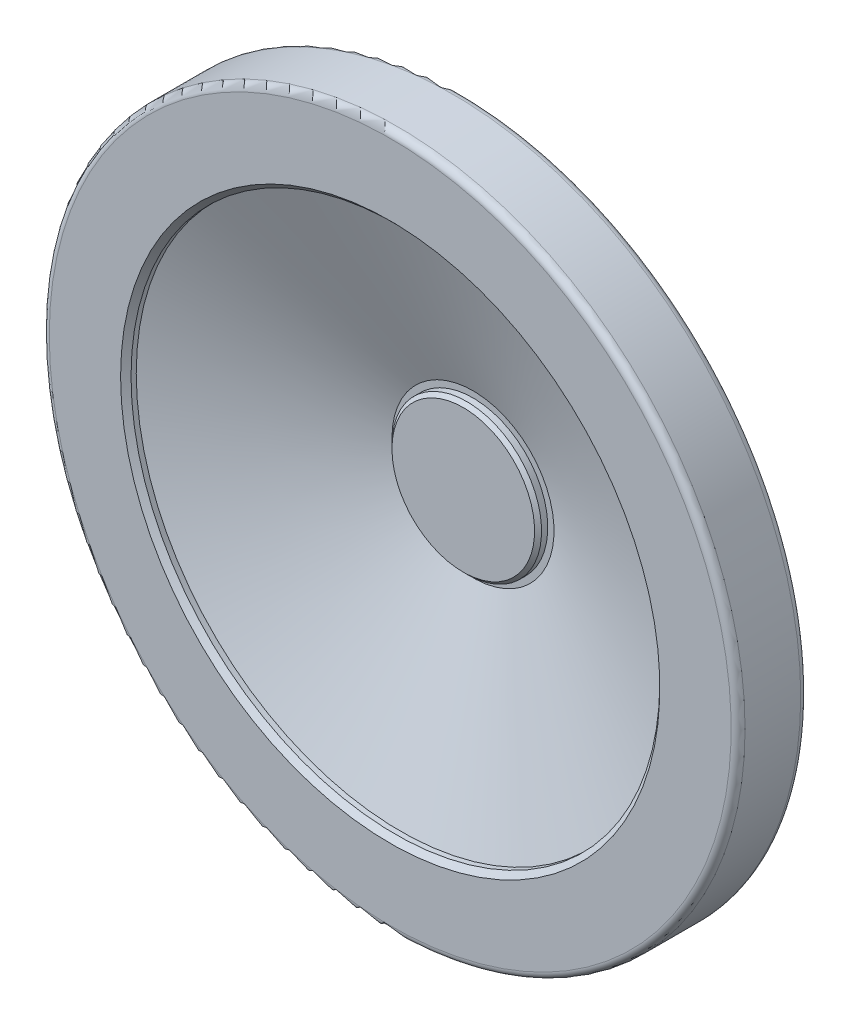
ISO-10303-21;
HEADER;
FILE_DESCRIPTION(('STEP AP214'),'2;1');
FILE_NAME('part.step','',(''),(''),'','','');
FILE_SCHEMA(('AUTOMOTIVE_DESIGN { 1 0 10303 214 1 1 1 1 }'));
ENDSEC;
DATA;
#1=APPLICATION_CONTEXT('core data for automotive mechanical design processes');
#2=APPLICATION_PROTOCOL_DEFINITION('international standard','automotive_design',2000,#1);
#3=PRODUCT_CONTEXT('',#1,'mechanical');
#4=PRODUCT('Part','Part','',(#3));
#5=PRODUCT_RELATED_PRODUCT_CATEGORY('part','',(#4));
#6=PRODUCT_DEFINITION_FORMATION('','',#4);
#7=PRODUCT_DEFINITION_CONTEXT('part definition',#1,'design');
#8=PRODUCT_DEFINITION('design','',#6,#7);
#9=PRODUCT_DEFINITION_SHAPE('','',#8);
#10=(LENGTH_UNIT() NAMED_UNIT(*) SI_UNIT(.MILLI.,.METRE.));
#11=(NAMED_UNIT(*) PLANE_ANGLE_UNIT() SI_UNIT($,.RADIAN.));
#12=(NAMED_UNIT(*) SI_UNIT($,.STERADIAN.) SOLID_ANGLE_UNIT());
#13=UNCERTAINTY_MEASURE_WITH_UNIT(LENGTH_MEASURE(1.E-05),#10,'distance_accuracy_value','');
#14=(GEOMETRIC_REPRESENTATION_CONTEXT(3) GLOBAL_UNCERTAINTY_ASSIGNED_CONTEXT((#13)) GLOBAL_UNIT_ASSIGNED_CONTEXT((#10,
#11,#12)) REPRESENTATION_CONTEXT('',''));
#15=CARTESIAN_POINT('',(0.,0.,0.));
#16=DIRECTION('',(0.,0.,1.));
#17=DIRECTION('',(1.,0.,0.));
#18=AXIS2_PLACEMENT_3D('',#15,#16,#17);
#19=CARTESIAN_POINT('',(0.,0.,54.));
#20=DIRECTION('',(0.,0.,1.));
#21=DIRECTION('',(-1.,0.,0.));
#22=AXIS2_PLACEMENT_3D('',#19,#20,#21);
#23=CONICAL_SURFACE('',#22,76.0000000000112,1.1950442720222);
#24=CARTESIAN_POINT('',(0.,0.,33.2042442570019));
#25=DIRECTION('',(0.,0.,1.));
#26=DIRECTION('',(-1.,0.,0.));
#27=AXIS2_PLACEMENT_3D('',#24,#25,#26);
#28=CIRCLE('',#27,23.2851773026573);
#29=CARTESIAN_POINT('',(-23.2851773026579,0.,33.2042442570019));
#30=VERTEX_POINT('',#29);
#31=EDGE_CURVE('E9',#30,#30,#28,.T.);
#32=CARTESIAN_POINT('',(0.,0.,54.));
#33=DIRECTION('',(0.,0.,1.));
#34=DIRECTION('',(-1.,0.,0.));
#35=AXIS2_PLACEMENT_3D('',#32,#33,#34);
#36=CIRCLE('',#35,76.0000000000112);
#37=CARTESIAN_POINT('',(-76.0000000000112,0.,54.));
#38=VERTEX_POINT('',#37);
#39=EDGE_CURVE('E59',#38,#38,#36,.T.);
#40=CARTESIAN_POINT('',(-23.2851773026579,0.,33.2042442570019));
#41=CARTESIAN_POINT('',(-23.8342900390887,0.,33.4208667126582));
#42=CARTESIAN_POINT('',(-24.3834027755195,0.,33.6374891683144));
#43=CARTESIAN_POINT('',(-25.481628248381,0.,34.0707340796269));
#44=CARTESIAN_POINT('',(-26.0307409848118,0.,34.2873565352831));
#45=CARTESIAN_POINT('',(-27.1289664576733,0.,34.7206014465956));
#46=CARTESIAN_POINT('',(-27.678079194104,0.,34.9372239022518));
#47=CARTESIAN_POINT('',(-28.7763046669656,0.,35.3704688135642));
#48=CARTESIAN_POINT('',(-29.3254174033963,0.,35.5870912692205));
#49=CARTESIAN_POINT('',(-30.4236428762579,0.,36.0203361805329));
#50=CARTESIAN_POINT('',(-30.9727556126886,0.,36.2369586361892));
#51=CARTESIAN_POINT('',(-32.0709810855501,0.,36.6702035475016));
#52=CARTESIAN_POINT('',(-32.6200938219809,0.,36.8868260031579));
#53=CARTESIAN_POINT('',(-33.7183192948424,0.,37.3200709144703));
#54=CARTESIAN_POINT('',(-34.2674320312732,0.,37.5366933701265));
#55=CARTESIAN_POINT('',(-35.3656575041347,0.,37.969938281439));
#56=CARTESIAN_POINT('',(-35.9147702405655,0.,38.1865607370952));
#57=CARTESIAN_POINT('',(-37.012995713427,0.,38.6198056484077));
#58=CARTESIAN_POINT('',(-37.5621084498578,0.,38.8364281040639));
#59=CARTESIAN_POINT('',(-38.6603339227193,0.,39.2696730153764));
#60=CARTESIAN_POINT('',(-39.2094466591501,0.,39.4862954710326));
#61=CARTESIAN_POINT('',(-40.3076721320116,0.,39.9195403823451));
#62=CARTESIAN_POINT('',(-40.8567848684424,0.,40.1361628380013));
#63=CARTESIAN_POINT('',(-41.9550103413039,0.,40.5694077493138));
#64=CARTESIAN_POINT('',(-42.5041230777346,0.,40.78603020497));
#65=CARTESIAN_POINT('',(-43.6023485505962,0.,41.2192751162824));
#66=CARTESIAN_POINT('',(-44.1514612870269,0.,41.4358975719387));
#67=CARTESIAN_POINT('',(-45.2496867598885,0.,41.8691424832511));
#68=CARTESIAN_POINT('',(-45.7987994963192,0.,42.0857649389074));
#69=CARTESIAN_POINT('',(-46.8970249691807,0.,42.5190098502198));
#70=CARTESIAN_POINT('',(-47.4461377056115,0.,42.7356323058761));
#71=CARTESIAN_POINT('',(-48.544363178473,0.,43.1688772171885));
#72=CARTESIAN_POINT('',(-49.0934759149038,0.,43.3854996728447));
#73=CARTESIAN_POINT('',(-50.1917013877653,0.,43.8187445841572));
#74=CARTESIAN_POINT('',(-50.7408141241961,0.,44.0353670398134));
#75=CARTESIAN_POINT('',(-51.8390395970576,0.,44.4686119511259));
#76=CARTESIAN_POINT('',(-52.3881523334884,0.,44.6852344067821));
#77=CARTESIAN_POINT('',(-53.4863778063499,0.,45.1184793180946));
#78=CARTESIAN_POINT('',(-54.0354905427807,0.,45.3351017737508));
#79=CARTESIAN_POINT('',(-55.1337160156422,0.,45.7683466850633));
#80=CARTESIAN_POINT('',(-55.682828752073,0.,45.9849691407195));
#81=CARTESIAN_POINT('',(-56.7810542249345,0.,46.418214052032));
#82=CARTESIAN_POINT('',(-57.3301669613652,0.,46.6348365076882));
#83=CARTESIAN_POINT('',(-58.4283924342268,0.,47.0680814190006));
#84=CARTESIAN_POINT('',(-58.9775051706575,0.,47.2847038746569));
#85=CARTESIAN_POINT('',(-60.0757306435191,0.,47.7179487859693));
#86=CARTESIAN_POINT('',(-60.6248433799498,0.,47.9345712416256));
#87=CARTESIAN_POINT('',(-61.7230688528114,0.,48.367816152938));
#88=CARTESIAN_POINT('',(-62.2721815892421,0.,48.5844386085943));
#89=CARTESIAN_POINT('',(-63.3704070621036,0.,49.0176835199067));
#90=CARTESIAN_POINT('',(-63.9195197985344,0.,49.2343059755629));
#91=CARTESIAN_POINT('',(-65.0177452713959,0.,49.6675508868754));
#92=CARTESIAN_POINT('',(-65.5668580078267,0.,49.8841733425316));
#93=CARTESIAN_POINT('',(-66.6650834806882,0.,50.3174182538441));
#94=CARTESIAN_POINT('',(-67.214196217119,0.,50.5340407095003));
#95=CARTESIAN_POINT('',(-68.3124216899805,0.,50.9672856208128));
#96=CARTESIAN_POINT('',(-68.8615344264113,0.,51.183908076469));
#97=CARTESIAN_POINT('',(-69.9597598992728,0.,51.6171529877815));
#98=CARTESIAN_POINT('',(-70.5088726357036,0.,51.8337754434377));
#99=CARTESIAN_POINT('',(-71.6070981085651,0.,52.2670203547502));
#100=CARTESIAN_POINT('',(-72.1562108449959,0.,52.4836428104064));
#101=CARTESIAN_POINT('',(-73.2544363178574,0.,52.9168877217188));
#102=CARTESIAN_POINT('',(-73.8035490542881,0.,53.1335101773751));
#103=CARTESIAN_POINT('',(-74.9017745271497,0.,53.5667550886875));
#104=CARTESIAN_POINT('',(-75.4508872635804,0.,53.7833775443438));
#105=CARTESIAN_POINT('',(-76.0000000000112,0.,54.));
#106=B_SPLINE_CURVE_WITH_KNOTS('',3,(#40,#41,#42,#43,#44,#45,#46,#47,#48,#49,#50,#51,#52,#53,
#54,#55,#56,#57,#58,#59,#60,#61,#62,#63,#64,#65,#66,#67,#68,#69,#70,#71,#72,#73,#74,#75,#76,#77,
#78,#79,#80,#81,#82,#83,#84,#85,#86,#87,#88,#89,#90,#91,#92,#93,#94,#95,#96,#97,#98,#99,#100,
#101,#102,#103,#104,#105),.UNSPECIFIED.,.F.,.F.,(4,2,2,2,2,2,2,2,2,2,2,2,2,2,2,2,2,2,2,2,2,2,2,
2,2,2,2,2,2,2,2,2,4),(0.,1.77088982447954,3.54177964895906,5.31266947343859,7.08355929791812,
8.85444912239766,10.6253389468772,12.3962287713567,14.1671185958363,15.9380084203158,
17.7088982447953,19.4797880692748,21.2506778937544,23.0215677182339,24.7924575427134,
26.563347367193,28.3342371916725,30.105127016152,31.8760168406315,33.6469066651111,
35.4177964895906,37.1886863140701,38.9595761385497,40.7304659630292,42.5013557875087,
44.2722456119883,46.0431354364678,47.8140252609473,49.5849150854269,51.3558049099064,
53.1266947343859,54.8975845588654,56.668474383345),.UNSPECIFIED.);
#107=EDGE_CURVE('BSEAM14',#30,#38,#106,.T.);
#108=ORIENTED_EDGE('',*,*,#31,.F.);
#109=ORIENTED_EDGE('',*,*,#39,.T.);
#110=ORIENTED_EDGE('',*,*,#107,.T.);
#111=ORIENTED_EDGE('',*,*,#107,.F.);
#112=EDGE_LOOP('',(#108,#110,#109,#111));
#113=FACE_BOUND('',#112,.T.);
#114=ADVANCED_FACE('F14',(#113),#23,.F.);
#115=CARTESIAN_POINT('',(0.,-23.2851773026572,33.2042442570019));
#116=DIRECTION('',(0.,0.,-1.));
#117=DIRECTION('',(1.,0.,0.));
#118=AXIS2_PLACEMENT_3D('',#115,#116,#117);
#119=PLANE('',#118);
#120=CARTESIAN_POINT('',(0.,0.,33.2042442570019));
#121=DIRECTION('',(0.,0.,1.));
#122=DIRECTION('',(-1.,0.,0.));
#123=AXIS2_PLACEMENT_3D('',#120,#121,#122);
#124=CIRCLE('',#123,21.500000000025);
#125=CARTESIAN_POINT('',(-21.500000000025,0.,33.2042442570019));
#126=VERTEX_POINT('',#125);
#127=EDGE_CURVE('E20',#126,#126,#124,.T.);
#128=ORIENTED_EDGE('',*,*,#127,.F.);
#129=EDGE_LOOP('',(#128));
#130=FACE_BOUND('',#129,.T.);
#131=ORIENTED_EDGE('',*,*,#31,.T.);
#132=EDGE_LOOP('',(#131));
#133=FACE_BOUND('',#132,.T.);
#134=ADVANCED_FACE('F50',(#130,#133),#119,.F.);
#135=CARTESIAN_POINT('',(0.,0.,72.));
#136=DIRECTION('',(0.,0.,1.));
#137=DIRECTION('',(-1.,0.,0.));
#138=AXIS2_PLACEMENT_3D('',#135,#136,#137);
#139=CYLINDRICAL_SURFACE('',#138,21.500000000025);
#140=CARTESIAN_POINT('',(0.,0.,35.));
#141=DIRECTION('',(0.,0.,1.));
#142=DIRECTION('',(-1.,0.,0.));
#143=AXIS2_PLACEMENT_3D('',#140,#141,#142);
#144=CIRCLE('',#143,21.500000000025);
#145=CARTESIAN_POINT('',(-21.500000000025,0.,35.));
#146=VERTEX_POINT('',#145);
#147=EDGE_CURVE('E37',#146,#146,#144,.T.);
#148=ORIENTED_EDGE('',*,*,#147,.F.);
#149=EDGE_LOOP('',(#148));
#150=FACE_BOUND('',#149,.T.);
#151=ORIENTED_EDGE('',*,*,#127,.T.);
#152=EDGE_LOOP('',(#151));
#153=FACE_BOUND('',#152,.T.);
#154=ADVANCED_FACE('F48',(#150,#153),#139,.T.);
#155=CARTESIAN_POINT('',(0.,0.,36.));
#156=DIRECTION('',(0.,0.,-1.));
#157=DIRECTION('',(1.,0.,0.));
#158=AXIS2_PLACEMENT_3D('',#155,#156,#157);
#159=CONICAL_SURFACE('',#158,20.5000000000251,0.785398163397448);
#160=ORIENTED_EDGE('',*,*,#147,.T.);
#161=EDGE_LOOP('',(#160));
#162=FACE_BOUND('',#161,.T.);
#163=CARTESIAN_POINT('',(0.,0.,36.));
#164=DIRECTION('',(0.,0.,1.));
#165=DIRECTION('',(-1.,0.,0.));
#166=AXIS2_PLACEMENT_3D('',#163,#164,#165);
#167=CIRCLE('',#166,20.5000000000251);
#168=CARTESIAN_POINT('',(-20.5000000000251,0.,36.));
#169=VERTEX_POINT('',#168);
#170=EDGE_CURVE('E33',#169,#169,#167,.T.);
#171=ORIENTED_EDGE('',*,*,#170,.F.);
#172=EDGE_LOOP('',(#171));
#173=FACE_BOUND('',#172,.T.);
#174=ADVANCED_FACE('F124',(#162,#173),#159,.T.);
#175=CARTESIAN_POINT('',(0.,-20.5000000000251,36.));
#176=DIRECTION('',(0.,0.,-1.));
#177=DIRECTION('',(1.,0.,0.));
#178=AXIS2_PLACEMENT_3D('',#175,#176,#177);
#179=PLANE('',#178);
#180=ORIENTED_EDGE('',*,*,#170,.T.);
#181=EDGE_LOOP('',(#180));
#182=FACE_BOUND('',#181,.T.);
#183=ADVANCED_FACE('F27',(#182),#179,.F.);
#184=CARTESIAN_POINT('',(0.,0.,15.));
#185=DIRECTION('',(0.,0.,-1.));
#186=DIRECTION('',(1.,0.,0.));
#187=AXIS2_PLACEMENT_3D('',#184,#185,#186);
#188=CONICAL_SURFACE('',#187,3.00000000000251,1.04719755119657);
#189=CARTESIAN_POINT('',(0.,0.,16.73205080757));
#190=VERTEX_POINT('',#189);
#191=VERTEX_LOOP('',#190);
#192=FACE_BOUND('',#191,.T.);
#193=CARTESIAN_POINT('',(0.,0.,15.));
#194=DIRECTION('',(0.,0.,1.));
#195=DIRECTION('',(-1.,0.,0.));
#196=AXIS2_PLACEMENT_3D('',#193,#194,#195);
#197=CIRCLE('',#196,3.00000000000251);
#198=CARTESIAN_POINT('',(-3.00000000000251,0.,15.));
#199=VERTEX_POINT('',#198);
#200=EDGE_CURVE('E31',#199,#199,#197,.T.);
#201=ORIENTED_EDGE('',*,*,#200,.F.);
#202=EDGE_LOOP('',(#201));
#203=FACE_BOUND('',#202,.T.);
#204=ADVANCED_FACE('F23',(#192,#203),#188,.F.);
#205=CARTESIAN_POINT('',(0.,0.,72.));
#206=DIRECTION('',(0.,0.,1.));
#207=DIRECTION('',(-1.,0.,0.));
#208=AXIS2_PLACEMENT_3D('',#205,#206,#207);
#209=CYLINDRICAL_SURFACE('',#208,3.00000000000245);
#210=ORIENTED_EDGE('',*,*,#200,.T.);
#211=EDGE_LOOP('',(#210));
#212=FACE_BOUND('',#211,.T.);
#213=CARTESIAN_POINT('',(0.,0.,0.));
#214=DIRECTION('',(0.,0.,1.));
#215=DIRECTION('',(-1.,0.,0.));
#216=AXIS2_PLACEMENT_3D('',#213,#214,#215);
#217=CIRCLE('',#216,3.00000000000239);
#218=CARTESIAN_POINT('',(-3.00000000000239,0.,0.));
#219=VERTEX_POINT('',#218);
#220=EDGE_CURVE('E34',#219,#219,#217,.T.);
#221=ORIENTED_EDGE('',*,*,#220,.F.);
#222=EDGE_LOOP('',(#221));
#223=FACE_BOUND('',#222,.T.);
#224=ADVANCED_FACE('F26',(#212,#223),#209,.F.);
#225=CARTESIAN_POINT('',(0.,-20.0000000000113,0.));
#226=DIRECTION('',(0.,0.,-1.));
#227=DIRECTION('',(1.,0.,0.));
#228=AXIS2_PLACEMENT_3D('',#225,#226,#227);
#229=PLANE('',#228);
#230=ORIENTED_EDGE('',*,*,#220,.T.);
#231=EDGE_LOOP('',(#230));
#232=FACE_BOUND('',#231,.T.);
#233=CARTESIAN_POINT('',(0.,0.,0.));
#234=DIRECTION('',(0.,0.,1.));
#235=DIRECTION('',(-1.,0.,0.));
#236=AXIS2_PLACEMENT_3D('',#233,#234,#235);
#237=CIRCLE('',#236,20.0000000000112);
#238=CARTESIAN_POINT('',(-20.0000000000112,0.,0.));
#239=VERTEX_POINT('',#238);
#240=EDGE_CURVE('E40',#239,#239,#237,.T.);
#241=ORIENTED_EDGE('',*,*,#240,.F.);
#242=EDGE_LOOP('',(#241));
#243=FACE_BOUND('',#242,.T.);
#244=ADVANCED_FACE('F106',(#232,#243),#229,.T.);
#245=CARTESIAN_POINT('',(0.,0.,0.));
#246=DIRECTION('',(0.,0.,1.));
#247=DIRECTION('',(-1.,0.,0.));
#248=AXIS2_PLACEMENT_3D('',#245,#246,#247);
#249=CONICAL_SURFACE('',#248,20.0000000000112,0.785398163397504);
#250=CARTESIAN_POINT('',(0.,0.,1.50000000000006));
#251=DIRECTION('',(0.,0.,1.));
#252=DIRECTION('',(-1.,0.,0.));
#253=AXIS2_PLACEMENT_3D('',#250,#251,#252);
#254=CIRCLE('',#253,21.5000000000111);
#255=CARTESIAN_POINT('',(-21.5000000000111,0.,1.50000000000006));
#256=VERTEX_POINT('',#255);
#257=EDGE_CURVE('E99',#256,#256,#254,.T.);
#258=ORIENTED_EDGE('',*,*,#257,.F.);
#259=EDGE_LOOP('',(#258));
#260=FACE_BOUND('',#259,.T.);
#261=ORIENTED_EDGE('',*,*,#240,.T.);
#262=EDGE_LOOP('',(#261));
#263=FACE_BOUND('',#262,.T.);
#264=ADVANCED_FACE('F104',(#260,#263),#249,.T.);
#265=CARTESIAN_POINT('',(0.,0.,72.));
#266=DIRECTION('',(0.,0.,1.));
#267=DIRECTION('',(-1.,0.,0.));
#268=AXIS2_PLACEMENT_3D('',#265,#266,#267);
#269=CYLINDRICAL_SURFACE('',#268,21.5000000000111);
#270=CARTESIAN_POINT('',(0.,0.,21.6));
#271=DIRECTION('',(0.,0.,1.));
#272=DIRECTION('',(-1.,0.,0.));
#273=AXIS2_PLACEMENT_3D('',#270,#271,#272);
#274=CIRCLE('',#273,21.5000000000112);
#275=CARTESIAN_POINT('',(-21.5000000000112,0.,21.6));
#276=VERTEX_POINT('',#275);
#277=EDGE_CURVE('E96',#276,#276,#274,.T.);
#278=ORIENTED_EDGE('',*,*,#277,.F.);
#279=EDGE_LOOP('',(#278));
#280=FACE_BOUND('',#279,.T.);
#281=ORIENTED_EDGE('',*,*,#257,.T.);
#282=EDGE_LOOP('',(#281));
#283=FACE_BOUND('',#282,.T.);
#284=ADVANCED_FACE('F116',(#280,#283),#269,.T.);
#285=CARTESIAN_POINT('',(0.,0.,21.6));
#286=DIRECTION('',(0.,0.,1.));
#287=DIRECTION('',(-1.,0.,0.));
#288=AXIS2_PLACEMENT_3D('',#285,#286,#287);
#289=TOROIDAL_SURFACE('',#288,21.9000000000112,0.399999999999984);
#290=ORIENTED_EDGE('',*,*,#277,.T.);
#291=EDGE_LOOP('',(#290));
#292=FACE_BOUND('',#291,.T.);
#293=CARTESIAN_POINT('',(0.,0.,22.));
#294=DIRECTION('',(0.,0.,1.));
#295=DIRECTION('',(-1.,0.,0.));
#296=AXIS2_PLACEMENT_3D('',#293,#294,#295);
#297=CIRCLE('',#296,21.9000000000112);
#298=CARTESIAN_POINT('',(-21.9000000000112,0.,22.));
#299=VERTEX_POINT('',#298);
#300=EDGE_CURVE('E93',#299,#299,#297,.T.);
#301=ORIENTED_EDGE('',*,*,#300,.F.);
#302=EDGE_LOOP('',(#301));
#303=FACE_BOUND('',#302,.T.);
#304=ADVANCED_FACE('F198',(#292,#303),#289,.F.);
#305=CARTESIAN_POINT('',(0.,-23.5000000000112,22.));
#306=DIRECTION('',(0.,0.,-1.));
#307=DIRECTION('',(1.,0.,0.));
#308=AXIS2_PLACEMENT_3D('',#305,#306,#307);
#309=PLANE('',#308);
#310=ORIENTED_EDGE('',*,*,#300,.T.);
#311=EDGE_LOOP('',(#310));
#312=FACE_BOUND('',#311,.T.);
#313=CARTESIAN_POINT('',(0.,0.,22.));
#314=DIRECTION('',(0.,0.,1.));
#315=DIRECTION('',(-1.,0.,0.));
#316=AXIS2_PLACEMENT_3D('',#313,#314,#315);
#317=CIRCLE('',#316,23.5000000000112);
#318=CARTESIAN_POINT('',(-23.5000000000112,0.,22.));
#319=VERTEX_POINT('',#318);
#320=EDGE_CURVE('E90',#319,#319,#317,.T.);
#321=ORIENTED_EDGE('',*,*,#320,.F.);
#322=EDGE_LOOP('',(#321));
#323=FACE_BOUND('',#322,.T.);
#324=ADVANCED_FACE('F205',(#312,#323),#309,.T.);
#325=CARTESIAN_POINT('',(0.,0.,72.));
#326=DIRECTION('',(0.,0.,1.));
#327=DIRECTION('',(-1.,0.,0.));
#328=AXIS2_PLACEMENT_3D('',#325,#326,#327);
#329=CYLINDRICAL_SURFACE('',#328,23.5000000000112);
#330=CARTESIAN_POINT('',(0.,0.,22.0271138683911));
#331=DIRECTION('',(0.,0.,1.));
#332=DIRECTION('',(-1.,0.,0.));
#333=AXIS2_PLACEMENT_3D('',#330,#331,#332);
#334=CIRCLE('',#333,23.5000000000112);
#335=CARTESIAN_POINT('',(-23.5000000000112,0.,22.0271138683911));
#336=VERTEX_POINT('',#335);
#337=EDGE_CURVE('E87',#336,#336,#334,.T.);
#338=ORIENTED_EDGE('',*,*,#337,.F.);
#339=EDGE_LOOP('',(#338));
#340=FACE_BOUND('',#339,.T.);
#341=ORIENTED_EDGE('',*,*,#320,.T.);
#342=EDGE_LOOP('',(#341));
#343=FACE_BOUND('',#342,.T.);
#344=ADVANCED_FACE('F214',(#340,#343),#329,.T.);
#345=CARTESIAN_POINT('',(0.,0.,22.0271138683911));
#346=DIRECTION('',(0.,0.,1.));
#347=DIRECTION('',(-1.,0.,0.));
#348=AXIS2_PLACEMENT_3D('',#345,#346,#347);
#349=TOROIDAL_SURFACE('',#348,28.5000000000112,5.);
#350=ORIENTED_EDGE('',*,*,#337,.T.);
#351=EDGE_LOOP('',(#350));
#352=FACE_BOUND('',#351,.T.);
#353=CARTESIAN_POINT('',(0.,0.,26.633698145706));
#354=DIRECTION('',(0.,0.,1.));
#355=DIRECTION('',(-1.,0.,0.));
#356=AXIS2_PLACEMENT_3D('',#353,#354,#355);
#357=CIRCLE('',#356,26.5559369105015);
#358=CARTESIAN_POINT('',(-26.5559369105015,0.,26.633698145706));
#359=VERTEX_POINT('',#358);
#360=EDGE_CURVE('E84',#359,#359,#357,.T.);
#361=ORIENTED_EDGE('',*,*,#360,.F.);
#362=EDGE_LOOP('',(#361));
#363=FACE_BOUND('',#362,.T.);
#364=ADVANCED_FACE('F223',(#352,#363),#349,.F.);
#365=CARTESIAN_POINT('',(0.,0.,26.633698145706));
#366=DIRECTION('',(0.,0.,1.));
#367=DIRECTION('',(-1.,0.,0.));
#368=AXIS2_PLACEMENT_3D('',#365,#366,#367);
#369=CONICAL_SURFACE('',#368,26.5559369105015,1.1714538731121);
#370=CARTESIAN_POINT('',(0.,0.,37.));
#371=DIRECTION('',(0.,0.,1.));
#372=DIRECTION('',(-1.,0.,0.));
#373=AXIS2_PLACEMENT_3D('',#370,#371,#372);
#374=CIRCLE('',#373,51.1195652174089);
#375=CARTESIAN_POINT('',(-51.1195652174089,0.,37.));
#376=VERTEX_POINT('',#375);
#377=EDGE_CURVE('E81',#376,#376,#374,.T.);
#378=ORIENTED_EDGE('',*,*,#377,.F.);
#379=EDGE_LOOP('',(#378));
#380=FACE_BOUND('',#379,.T.);
#381=ORIENTED_EDGE('',*,*,#360,.T.);
#382=EDGE_LOOP('',(#381));
#383=FACE_BOUND('',#382,.T.);
#384=ADVANCED_FACE('F232',(#380,#383),#369,.T.);
#385=CARTESIAN_POINT('',(0.,-98.000000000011,37.));
#386=DIRECTION('',(0.,0.,-1.));
#387=DIRECTION('',(1.,0.,0.));
#388=AXIS2_PLACEMENT_3D('',#385,#386,#387);
#389=PLANE('',#388);
#390=ORIENTED_EDGE('',*,*,#377,.T.);
#391=EDGE_LOOP('',(#390));
#392=FACE_BOUND('',#391,.T.);
#393=CARTESIAN_POINT('',(0.,0.,37.));
#394=DIRECTION('',(0.,0.,1.));
#395=DIRECTION('',(-1.,0.,0.));
#396=AXIS2_PLACEMENT_3D('',#393,#394,#395);
#397=CIRCLE('',#396,98.0000000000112);
#398=CARTESIAN_POINT('',(-98.0000000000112,0.,37.));
#399=VERTEX_POINT('',#398);
#400=EDGE_CURVE('E78',#399,#399,#397,.T.);
#401=ORIENTED_EDGE('',*,*,#400,.F.);
#402=EDGE_LOOP('',(#401));
#403=FACE_BOUND('',#402,.T.);
#404=ADVANCED_FACE('F241',(#392,#403),#389,.T.);
#405=CARTESIAN_POINT('',(0.,0.,39.));
#406=DIRECTION('',(0.,0.,1.));
#407=DIRECTION('',(-1.,0.,0.));
#408=AXIS2_PLACEMENT_3D('',#405,#406,#407);
#409=TOROIDAL_SURFACE('',#408,98.0000000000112,2.);
#410=CARTESIAN_POINT('',(0.,0.,39.));
#411=DIRECTION('',(0.,0.,1.));
#412=DIRECTION('',(-1.,0.,0.));
#413=AXIS2_PLACEMENT_3D('',#410,#411,#412);
#414=CIRCLE('',#413,100.000000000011);
#415=CARTESIAN_POINT('',(-100.000000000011,0.,39.));
#416=VERTEX_POINT('',#415);
#417=EDGE_CURVE('E75',#416,#416,#414,.T.);
#418=ORIENTED_EDGE('',*,*,#417,.F.);
#419=EDGE_LOOP('',(#418));
#420=FACE_BOUND('',#419,.T.);
#421=ORIENTED_EDGE('',*,*,#400,.T.);
#422=EDGE_LOOP('',(#421));
#423=FACE_BOUND('',#422,.T.);
#424=ADVANCED_FACE('F250',(#420,#423),#409,.T.);
#425=CARTESIAN_POINT('',(0.,0.,72.));
#426=DIRECTION('',(0.,0.,1.));
#427=DIRECTION('',(-1.,0.,0.));
#428=AXIS2_PLACEMENT_3D('',#425,#426,#427);
#429=CYLINDRICAL_SURFACE('',#428,100.000000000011);
#430=ORIENTED_EDGE('',*,*,#417,.T.);
#431=EDGE_LOOP('',(#430));
#432=FACE_BOUND('',#431,.T.);
#433=CARTESIAN_POINT('',(0.,0.,55.));
#434=DIRECTION('',(0.,0.,1.));
#435=DIRECTION('',(-1.,0.,0.));
#436=AXIS2_PLACEMENT_3D('',#433,#434,#435);
#437=CIRCLE('',#436,100.000000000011);
#438=CARTESIAN_POINT('',(-100.000000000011,0.,55.));
#439=VERTEX_POINT('',#438);
#440=EDGE_CURVE('E72',#439,#439,#437,.T.);
#441=ORIENTED_EDGE('',*,*,#440,.F.);
#442=EDGE_LOOP('',(#441));
#443=FACE_BOUND('',#442,.T.);
#444=ADVANCED_FACE('F259',(#432,#443),#429,.T.);
#445=CARTESIAN_POINT('',(0.,0.,55.));
#446=DIRECTION('',(0.,0.,1.));
#447=DIRECTION('',(-1.,0.,0.));
#448=AXIS2_PLACEMENT_3D('',#445,#446,#447);
#449=TOROIDAL_SURFACE('',#448,98.0000000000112,2.);
#450=CARTESIAN_POINT('',(0.,0.,57.));
#451=DIRECTION('',(0.,0.,1.));
#452=DIRECTION('',(-1.,0.,0.));
#453=AXIS2_PLACEMENT_3D('',#450,#451,#452);
#454=CIRCLE('',#453,98.0000000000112);
#455=CARTESIAN_POINT('',(-98.0000000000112,0.,57.));
#456=VERTEX_POINT('',#455);
#457=EDGE_CURVE('E69',#456,#456,#454,.T.);
#458=ORIENTED_EDGE('',*,*,#457,.F.);
#459=EDGE_LOOP('',(#458));
#460=FACE_BOUND('',#459,.T.);
#461=ORIENTED_EDGE('',*,*,#440,.T.);
#462=EDGE_LOOP('',(#461));
#463=FACE_BOUND('',#462,.T.);
#464=ADVANCED_FACE('F268',(#460,#463),#449,.T.);
#465=CARTESIAN_POINT('',(0.,-98.000000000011,57.));
#466=DIRECTION('',(0.,0.,-1.));
#467=DIRECTION('',(1.,0.,0.));
#468=AXIS2_PLACEMENT_3D('',#465,#466,#467);
#469=PLANE('',#468);
#470=CARTESIAN_POINT('',(0.,0.,57.));
#471=DIRECTION('',(0.,0.,1.));
#472=DIRECTION('',(-1.,0.,0.));
#473=AXIS2_PLACEMENT_3D('',#470,#471,#472);
#474=CIRCLE('',#473,77.5000000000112);
#475=CARTESIAN_POINT('',(-77.5000000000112,0.,57.));
#476=VERTEX_POINT('',#475);
#477=EDGE_CURVE('E64',#476,#476,#474,.T.);
#478=ORIENTED_EDGE('',*,*,#477,.F.);
#479=EDGE_LOOP('',(#478));
#480=FACE_BOUND('',#479,.T.);
#481=ORIENTED_EDGE('',*,*,#457,.T.);
#482=EDGE_LOOP('',(#481));
#483=FACE_BOUND('',#482,.T.);
#484=ADVANCED_FACE('F277',(#480,#483),#469,.F.);
#485=CARTESIAN_POINT('',(0.,0.,55.5));
#486=DIRECTION('',(0.,0.,1.));
#487=DIRECTION('',(-1.,0.,0.));
#488=AXIS2_PLACEMENT_3D('',#485,#486,#487);
#489=CONICAL_SURFACE('',#488,76.0000000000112,0.785398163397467);
#490=ORIENTED_EDGE('',*,*,#477,.T.);
#491=EDGE_LOOP('',(#490));
#492=FACE_BOUND('',#491,.T.);
#493=CARTESIAN_POINT('',(0.,0.,55.5));
#494=DIRECTION('',(0.,0.,1.));
#495=DIRECTION('',(-1.,0.,0.));
#496=AXIS2_PLACEMENT_3D('',#493,#494,#495);
#497=CIRCLE('',#496,76.0000000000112);
#498=CARTESIAN_POINT('',(-76.0000000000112,0.,55.5));
#499=VERTEX_POINT('',#498);
#500=EDGE_CURVE('E61',#499,#499,#497,.T.);
#501=ORIENTED_EDGE('',*,*,#500,.F.);
#502=EDGE_LOOP('',(#501));
#503=FACE_BOUND('',#502,.T.);
#504=ADVANCED_FACE('F286',(#492,#503),#489,.F.);
#505=CARTESIAN_POINT('',(0.,0.,72.));
#506=DIRECTION('',(0.,0.,1.));
#507=DIRECTION('',(-1.,0.,0.));
#508=AXIS2_PLACEMENT_3D('',#505,#506,#507);
#509=CYLINDRICAL_SURFACE('',#508,76.0000000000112);
#510=ORIENTED_EDGE('',*,*,#39,.F.);
#511=EDGE_LOOP('',(#510));
#512=FACE_BOUND('',#511,.T.);
#513=ORIENTED_EDGE('',*,*,#500,.T.);
#514=EDGE_LOOP('',(#513));
#515=FACE_BOUND('',#514,.T.);
#516=ADVANCED_FACE('F295',(#512,#515),#509,.F.);
#517=CLOSED_SHELL('',(#114,#134,#154,#174,#183,#204,#224,#244,#264,#284,#304,#324,#344,#364,
#384,#404,#424,#444,#464,#484,#504,#516));
#518=MANIFOLD_SOLID_BREP('B1',#517);
#519=ADVANCED_BREP_SHAPE_REPRESENTATION('',(#18,#518),#14);
#520=SHAPE_DEFINITION_REPRESENTATION(#9,#519);
ENDSEC;
END-ISO-10303-21;
